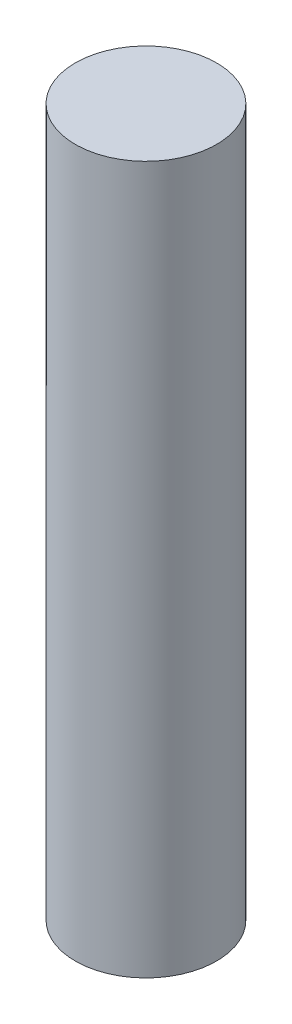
ISO-10303-21;
HEADER;
FILE_DESCRIPTION(('STEP AP214'),'2;1');
FILE_NAME('part.step','',(''),(''),'','','');
FILE_SCHEMA(('AUTOMOTIVE_DESIGN { 1 0 10303 214 1 1 1 1 }'));
ENDSEC;
DATA;
#1=APPLICATION_CONTEXT('core data for automotive mechanical design processes');
#2=APPLICATION_PROTOCOL_DEFINITION('international standard','automotive_design',2000,#1);
#3=PRODUCT_CONTEXT('',#1,'mechanical');
#4=PRODUCT('Part','Part','',(#3));
#5=PRODUCT_RELATED_PRODUCT_CATEGORY('part','',(#4));
#6=PRODUCT_DEFINITION_FORMATION('','',#4);
#7=PRODUCT_DEFINITION_CONTEXT('part definition',#1,'design');
#8=PRODUCT_DEFINITION('design','',#6,#7);
#9=PRODUCT_DEFINITION_SHAPE('','',#8);
#10=(LENGTH_UNIT() NAMED_UNIT(*) SI_UNIT(.MILLI.,.METRE.));
#11=(NAMED_UNIT(*) PLANE_ANGLE_UNIT() SI_UNIT($,.RADIAN.));
#12=(NAMED_UNIT(*) SI_UNIT($,.STERADIAN.) SOLID_ANGLE_UNIT());
#13=UNCERTAINTY_MEASURE_WITH_UNIT(LENGTH_MEASURE(1.E-05),#10,'distance_accuracy_value','');
#14=(GEOMETRIC_REPRESENTATION_CONTEXT(3) GLOBAL_UNCERTAINTY_ASSIGNED_CONTEXT((#13)) GLOBAL_UNIT_ASSIGNED_CONTEXT((#10,
#11,#12)) REPRESENTATION_CONTEXT('',''));
#15=CARTESIAN_POINT('',(0.,0.,0.));
#16=DIRECTION('',(0.,0.,1.));
#17=DIRECTION('',(1.,0.,0.));
#18=AXIS2_PLACEMENT_3D('',#15,#16,#17);
#19=CARTESIAN_POINT('',(-41.8426783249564,12.4674356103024,0.));
#20=DIRECTION('',(0.,1.,0.));
#21=DIRECTION('',(-1.,0.,0.));
#22=AXIS2_PLACEMENT_3D('',#19,#20,#21);
#23=PLANE('',#22);
#24=CARTESIAN_POINT('',(-41.8426783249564,12.4674356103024,0.));
#25=DIRECTION('',(0.,1.,0.));
#26=DIRECTION('',(-1.,0.,0.));
#27=AXIS2_PLACEMENT_3D('',#24,#25,#26);
#28=CIRCLE('',#27,2.269);
#29=CARTESIAN_POINT('',(-44.1116783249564,12.4674356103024,0.));
#30=VERTEX_POINT('',#29);
#31=EDGE_CURVE('E10',#30,#30,#28,.T.);
#32=ORIENTED_EDGE('',*,*,#31,.F.);
#33=EDGE_LOOP('',(#32));
#34=FACE_BOUND('',#33,.T.);
#35=ADVANCED_FACE('F28',(#34),#23,.F.);
#36=CARTESIAN_POINT('',(-41.8426783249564,35.1774356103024,0.));
#37=DIRECTION('',(0.,1.,0.));
#38=DIRECTION('',(-1.,0.,0.));
#39=AXIS2_PLACEMENT_3D('',#36,#37,#38);
#40=CYLINDRICAL_SURFACE('',#39,2.269);
#41=CARTESIAN_POINT('',(-41.8426783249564,35.1774356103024,0.));
#42=DIRECTION('',(0.,1.,0.));
#43=DIRECTION('',(-1.,0.,0.));
#44=AXIS2_PLACEMENT_3D('',#41,#42,#43);
#45=CIRCLE('',#44,2.26899999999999);
#46=CARTESIAN_POINT('',(-44.1116783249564,35.1774356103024,0.));
#47=VERTEX_POINT('',#46);
#48=EDGE_CURVE('E34',#47,#47,#45,.T.);
#49=ORIENTED_EDGE('',*,*,#48,.F.);
#50=EDGE_LOOP('',(#49));
#51=FACE_BOUND('',#50,.T.);
#52=ORIENTED_EDGE('',*,*,#31,.T.);
#53=EDGE_LOOP('',(#52));
#54=FACE_BOUND('',#53,.T.);
#55=ADVANCED_FACE('F42',(#51,#54),#40,.T.);
#56=CARTESIAN_POINT('',(-41.8426783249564,35.1774356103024,0.));
#57=DIRECTION('',(0.,-1.,0.));
#58=DIRECTION('',(1.,0.,0.));
#59=AXIS2_PLACEMENT_3D('',#56,#57,#58);
#60=PLANE('',#59);
#61=ORIENTED_EDGE('',*,*,#48,.T.);
#62=EDGE_LOOP('',(#61));
#63=FACE_BOUND('',#62,.T.);
#64=ADVANCED_FACE('F40',(#63),#60,.F.);
#65=CLOSED_SHELL('',(#35,#55,#64));
#66=MANIFOLD_SOLID_BREP('B2',#65);
#67=ADVANCED_BREP_SHAPE_REPRESENTATION('',(#18,#66),#14);
#68=SHAPE_DEFINITION_REPRESENTATION(#9,#67);
ENDSEC;
END-ISO-10303-21;
